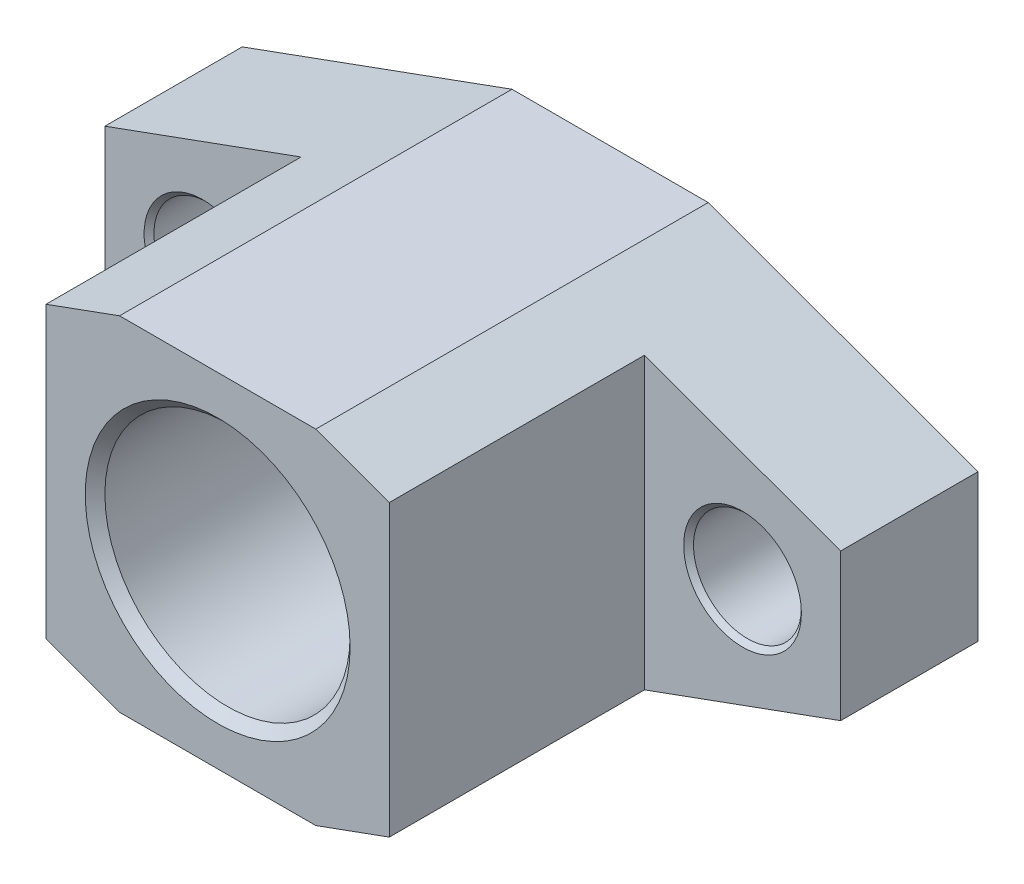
ISO-10303-21;
HEADER;
FILE_DESCRIPTION(('STEP AP214'),'2;1');
FILE_NAME('part.step','',(''),(''),'','','');
FILE_SCHEMA(('AUTOMOTIVE_DESIGN { 1 0 10303 214 1 1 1 1 }'));
ENDSEC;
DATA;
#1=APPLICATION_CONTEXT('core data for automotive mechanical design processes');
#2=APPLICATION_PROTOCOL_DEFINITION('international standard','automotive_design',2000,#1);
#3=PRODUCT_CONTEXT('',#1,'mechanical');
#4=PRODUCT('Part','Part','',(#3));
#5=PRODUCT_RELATED_PRODUCT_CATEGORY('part','',(#4));
#6=PRODUCT_DEFINITION_FORMATION('','',#4);
#7=PRODUCT_DEFINITION_CONTEXT('part definition',#1,'design');
#8=PRODUCT_DEFINITION('design','',#6,#7);
#9=PRODUCT_DEFINITION_SHAPE('','',#8);
#10=(LENGTH_UNIT() NAMED_UNIT(*) SI_UNIT(.MILLI.,.METRE.));
#11=(NAMED_UNIT(*) PLANE_ANGLE_UNIT() SI_UNIT($,.RADIAN.));
#12=(NAMED_UNIT(*) SI_UNIT($,.STERADIAN.) SOLID_ANGLE_UNIT());
#13=UNCERTAINTY_MEASURE_WITH_UNIT(LENGTH_MEASURE(1.E-05),#10,'distance_accuracy_value','');
#14=(GEOMETRIC_REPRESENTATION_CONTEXT(3) GLOBAL_UNCERTAINTY_ASSIGNED_CONTEXT((#13)) GLOBAL_UNIT_ASSIGNED_CONTEXT((#10,
#11,#12)) REPRESENTATION_CONTEXT('',''));
#15=CARTESIAN_POINT('',(0.,0.,0.));
#16=DIRECTION('',(0.,0.,1.));
#17=DIRECTION('',(1.,0.,0.));
#18=AXIS2_PLACEMENT_3D('',#15,#16,#17);
#19=CARTESIAN_POINT('',(-37.5,7.49081855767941,14.));
#20=DIRECTION('',(0.,0.,1.));
#21=DIRECTION('',(1.,0.,0.));
#22=AXIS2_PLACEMENT_3D('',#19,#20,#21);
#23=PLANE('',#22);
#24=CARTESIAN_POINT('',(27.5,0.,14.));
#25=DIRECTION('',(0.,0.,1.));
#26=DIRECTION('',(1.,0.,0.));
#27=AXIS2_PLACEMENT_3D('',#24,#25,#26);
#28=CIRCLE('',#27,6.);
#29=CARTESIAN_POINT('',(33.5,0.,14.));
#30=VERTEX_POINT('',#29);
#31=EDGE_CURVE('E486',#30,#30,#28,.T.);
#32=ORIENTED_EDGE('',*,*,#31,.F.);
#33=EDGE_LOOP('',(#32));
#34=FACE_BOUND('',#33,.T.);
#35=DIRECTION('',(0.,1.,0.));
#36=VECTOR('',#35,1.);
#37=CARTESIAN_POINT('',(17.5,14.7702232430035,14.));
#38=LINE('',#37,#36);
#39=CARTESIAN_POINT('',(17.5,-14.7702232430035,14.));
#40=VERTEX_POINT('',#39);
#41=CARTESIAN_POINT('',(17.5,14.7702232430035,14.));
#42=VERTEX_POINT('',#41);
#43=EDGE_CURVE('E35',#40,#42,#38,.T.);
#44=ORIENTED_EDGE('',*,*,#43,.F.);
#45=DIRECTION('',(0.939692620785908,0.342020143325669,0.));
#46=VECTOR('',#45,1.);
#47=CARTESIAN_POINT('',(10.,-17.5,14.));
#48=LINE('',#47,#46);
#49=CARTESIAN_POINT('',(37.5,-7.49081855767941,14.));
#50=VERTEX_POINT('',#49);
#51=EDGE_CURVE('E161',#40,#50,#48,.T.);
#52=ORIENTED_EDGE('',*,*,#51,.T.);
#53=DIRECTION('',(0.,1.,0.));
#54=VECTOR('',#53,1.);
#55=CARTESIAN_POINT('',(37.5,7.49081855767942,14.));
#56=LINE('',#55,#54);
#57=CARTESIAN_POINT('',(37.5,7.49081855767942,14.));
#58=VERTEX_POINT('',#57);
#59=EDGE_CURVE('E167',#50,#58,#56,.T.);
#60=ORIENTED_EDGE('',*,*,#59,.T.);
#61=DIRECTION('',(-0.939692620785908,0.342020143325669,0.));
#62=VECTOR('',#61,1.);
#63=CARTESIAN_POINT('',(10.,17.5,14.));
#64=LINE('',#63,#62);
#65=EDGE_CURVE('E31',#58,#42,#64,.T.);
#66=ORIENTED_EDGE('',*,*,#65,.T.);
#67=EDGE_LOOP('',(#44,#52,#60,#66));
#68=FACE_BOUND('',#67,.T.);
#69=ADVANCED_FACE('F14',(#34,#68),#23,.T.);
#70=CARTESIAN_POINT('',(-10.,17.5,14.));
#71=DIRECTION('',(0.342020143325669,-0.939692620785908,0.));
#72=DIRECTION('',(0.939692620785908,0.342020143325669,0.));
#73=AXIS2_PLACEMENT_3D('',#70,#71,#72);
#74=PLANE('',#73);
#75=DIRECTION('',(-0.939692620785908,-0.342020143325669,0.));
#76=VECTOR('',#75,1.);
#77=CARTESIAN_POINT('',(-10.,17.5,0.));
#78=LINE('',#77,#76);
#79=CARTESIAN_POINT('',(-10.,17.5,0.));
#80=VERTEX_POINT('',#79);
#81=CARTESIAN_POINT('',(-37.5,7.49081855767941,0.));
#82=VERTEX_POINT('',#81);
#83=EDGE_CURVE('E130',#80,#82,#78,.T.);
#84=ORIENTED_EDGE('',*,*,#83,.T.);
#85=DIRECTION('',(0.,0.,-1.));
#86=VECTOR('',#85,1.);
#87=CARTESIAN_POINT('',(-37.5,7.49081855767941,14.));
#88=LINE('',#87,#86);
#89=CARTESIAN_POINT('',(-37.5,7.49081855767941,14.));
#90=VERTEX_POINT('',#89);
#91=EDGE_CURVE('E9',#90,#82,#88,.T.);
#92=ORIENTED_EDGE('',*,*,#91,.F.);
#93=DIRECTION('',(-0.939692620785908,-0.342020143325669,0.));
#94=VECTOR('',#93,1.);
#95=CARTESIAN_POINT('',(-10.,17.5,14.));
#96=LINE('',#95,#94);
#97=CARTESIAN_POINT('',(-17.5,14.7702232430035,14.));
#98=VERTEX_POINT('',#97);
#99=EDGE_CURVE('E129',#98,#90,#96,.T.);
#100=ORIENTED_EDGE('',*,*,#99,.F.);
#101=DIRECTION('',(0.,0.,-1.));
#102=VECTOR('',#101,1.);
#103=CARTESIAN_POINT('',(-17.5,14.7702232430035,40.));
#104=LINE('',#103,#102);
#105=CARTESIAN_POINT('',(-17.5,14.7702232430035,40.));
#106=VERTEX_POINT('',#105);
#107=EDGE_CURVE('E108',#106,#98,#104,.T.);
#108=ORIENTED_EDGE('',*,*,#107,.F.);
#109=DIRECTION('',(-0.939692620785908,-0.342020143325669,0.));
#110=VECTOR('',#109,1.);
#111=CARTESIAN_POINT('',(-10.,17.5,40.));
#112=LINE('',#111,#110);
#113=CARTESIAN_POINT('',(-10.,17.5,40.));
#114=VERTEX_POINT('',#113);
#115=EDGE_CURVE('E115',#114,#106,#112,.T.);
#116=ORIENTED_EDGE('',*,*,#115,.F.);
#117=DIRECTION('',(0.,0.,-1.));
#118=VECTOR('',#117,1.);
#119=CARTESIAN_POINT('',(-10.,17.5,14.));
#120=LINE('',#119,#118);
#121=EDGE_CURVE('E172',#114,#80,#120,.T.);
#122=ORIENTED_EDGE('',*,*,#121,.T.);
#123=EDGE_LOOP('',(#84,#92,#100,#108,#116,#122));
#124=FACE_BOUND('',#123,.T.);
#125=ADVANCED_FACE('F16',(#124),#74,.F.);
#126=CARTESIAN_POINT('',(-37.5,7.49081855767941,14.));
#127=DIRECTION('',(1.,0.,0.));
#128=DIRECTION('',(0.,0.,-1.));
#129=AXIS2_PLACEMENT_3D('',#126,#127,#128);
#130=PLANE('',#129);
#131=DIRECTION('',(0.,-1.,0.));
#132=VECTOR('',#131,1.);
#133=CARTESIAN_POINT('',(-37.5,7.49081855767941,0.));
#134=LINE('',#133,#132);
#135=CARTESIAN_POINT('',(-37.5,-7.49081855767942,0.));
#136=VERTEX_POINT('',#135);
#137=EDGE_CURVE('E132',#82,#136,#134,.T.);
#138=ORIENTED_EDGE('',*,*,#137,.T.);
#139=DIRECTION('',(0.,0.,-1.));
#140=VECTOR('',#139,1.);
#141=CARTESIAN_POINT('',(-37.5,-7.49081855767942,14.));
#142=LINE('',#141,#140);
#143=CARTESIAN_POINT('',(-37.5,-7.49081855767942,14.));
#144=VERTEX_POINT('',#143);
#145=EDGE_CURVE('E23',#144,#136,#142,.T.);
#146=ORIENTED_EDGE('',*,*,#145,.F.);
#147=DIRECTION('',(0.,-1.,0.));
#148=VECTOR('',#147,1.);
#149=CARTESIAN_POINT('',(-37.5,7.49081855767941,14.));
#150=LINE('',#149,#148);
#151=EDGE_CURVE('E153',#90,#144,#150,.T.);
#152=ORIENTED_EDGE('',*,*,#151,.F.);
#153=ORIENTED_EDGE('',*,*,#91,.T.);
#154=EDGE_LOOP('',(#138,#146,#152,#153));
#155=FACE_BOUND('',#154,.T.);
#156=ADVANCED_FACE('F244',(#155),#130,.F.);
#157=CARTESIAN_POINT('',(-10.,-17.5,14.));
#158=DIRECTION('',(0.342020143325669,0.939692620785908,0.));
#159=DIRECTION('',(-0.939692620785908,0.342020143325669,0.));
#160=AXIS2_PLACEMENT_3D('',#157,#158,#159);
#161=PLANE('',#160);
#162=DIRECTION('',(0.939692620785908,-0.342020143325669,0.));
#163=VECTOR('',#162,1.);
#164=CARTESIAN_POINT('',(-10.,-17.5,0.));
#165=LINE('',#164,#163);
#166=CARTESIAN_POINT('',(-10.,-17.5,0.));
#167=VERTEX_POINT('',#166);
#168=EDGE_CURVE('E288',#136,#167,#165,.T.);
#169=ORIENTED_EDGE('',*,*,#168,.T.);
#170=DIRECTION('',(0.,0.,-1.));
#171=VECTOR('',#170,1.);
#172=CARTESIAN_POINT('',(-10.,-17.5,14.));
#173=LINE('',#172,#171);
#174=CARTESIAN_POINT('',(-10.,-17.5,40.));
#175=VERTEX_POINT('',#174);
#176=EDGE_CURVE('E268',#175,#167,#173,.T.);
#177=ORIENTED_EDGE('',*,*,#176,.F.);
#178=DIRECTION('',(0.939692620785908,-0.342020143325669,0.));
#179=VECTOR('',#178,1.);
#180=CARTESIAN_POINT('',(-17.5,-14.7702232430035,40.));
#181=LINE('',#180,#179);
#182=CARTESIAN_POINT('',(-17.5,-14.7702232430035,40.));
#183=VERTEX_POINT('',#182);
#184=EDGE_CURVE('E114',#183,#175,#181,.T.);
#185=ORIENTED_EDGE('',*,*,#184,.F.);
#186=DIRECTION('',(0.,0.,-1.));
#187=VECTOR('',#186,1.);
#188=CARTESIAN_POINT('',(-17.5,-14.7702232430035,40.));
#189=LINE('',#188,#187);
#190=CARTESIAN_POINT('',(-17.5,-14.7702232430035,14.));
#191=VERTEX_POINT('',#190);
#192=EDGE_CURVE('E110',#183,#191,#189,.T.);
#193=ORIENTED_EDGE('',*,*,#192,.T.);
#194=DIRECTION('',(0.939692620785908,-0.342020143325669,0.));
#195=VECTOR('',#194,1.);
#196=CARTESIAN_POINT('',(-10.,-17.5,14.));
#197=LINE('',#196,#195);
#198=EDGE_CURVE('E159',#144,#191,#197,.T.);
#199=ORIENTED_EDGE('',*,*,#198,.F.);
#200=ORIENTED_EDGE('',*,*,#145,.T.);
#201=EDGE_LOOP('',(#169,#177,#185,#193,#199,#200));
#202=FACE_BOUND('',#201,.T.);
#203=ADVANCED_FACE('F265',(#202),#161,.F.);
#204=CARTESIAN_POINT('',(10.,-17.5,14.));
#205=DIRECTION('',(0.,1.,0.));
#206=DIRECTION('',(-1.,0.,0.));
#207=AXIS2_PLACEMENT_3D('',#204,#205,#206);
#208=PLANE('',#207);
#209=DIRECTION('',(1.,0.,0.));
#210=VECTOR('',#209,1.);
#211=CARTESIAN_POINT('',(10.,-17.5,0.));
#212=LINE('',#211,#210);
#213=CARTESIAN_POINT('',(10.,-17.5,0.));
#214=VERTEX_POINT('',#213);
#215=EDGE_CURVE('E274',#167,#214,#212,.T.);
#216=ORIENTED_EDGE('',*,*,#215,.T.);
#217=DIRECTION('',(0.,0.,-1.));
#218=VECTOR('',#217,1.);
#219=CARTESIAN_POINT('',(10.,-17.5,14.));
#220=LINE('',#219,#218);
#221=CARTESIAN_POINT('',(10.,-17.5,40.));
#222=VERTEX_POINT('',#221);
#223=EDGE_CURVE('E273',#222,#214,#220,.T.);
#224=ORIENTED_EDGE('',*,*,#223,.F.);
#225=DIRECTION('',(1.,0.,0.));
#226=VECTOR('',#225,1.);
#227=CARTESIAN_POINT('',(-10.,-17.5,40.));
#228=LINE('',#227,#226);
#229=EDGE_CURVE('E185',#175,#222,#228,.T.);
#230=ORIENTED_EDGE('',*,*,#229,.F.);
#231=ORIENTED_EDGE('',*,*,#176,.T.);
#232=EDGE_LOOP('',(#216,#224,#230,#231));
#233=FACE_BOUND('',#232,.T.);
#234=ADVANCED_FACE('F271',(#233),#208,.F.);
#235=CARTESIAN_POINT('',(10.,-17.5,14.));
#236=DIRECTION('',(-0.342020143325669,0.939692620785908,0.));
#237=DIRECTION('',(-0.939692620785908,-0.342020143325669,0.));
#238=AXIS2_PLACEMENT_3D('',#235,#236,#237);
#239=PLANE('',#238);
#240=DIRECTION('',(0.939692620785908,0.342020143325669,0.));
#241=VECTOR('',#240,1.);
#242=CARTESIAN_POINT('',(10.,-17.5,0.));
#243=LINE('',#242,#241);
#244=CARTESIAN_POINT('',(37.5,-7.49081855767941,0.));
#245=VERTEX_POINT('',#244);
#246=EDGE_CURVE('E285',#214,#245,#243,.T.);
#247=ORIENTED_EDGE('',*,*,#246,.T.);
#248=DIRECTION('',(0.,0.,-1.));
#249=VECTOR('',#248,1.);
#250=CARTESIAN_POINT('',(37.5,-7.49081855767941,14.));
#251=LINE('',#250,#249);
#252=EDGE_CURVE('E209',#50,#245,#251,.T.);
#253=ORIENTED_EDGE('',*,*,#252,.F.);
#254=ORIENTED_EDGE('',*,*,#51,.F.);
#255=DIRECTION('',(0.,0.,-1.));
#256=VECTOR('',#255,1.);
#257=CARTESIAN_POINT('',(17.5,-14.7702232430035,40.));
#258=LINE('',#257,#256);
#259=CARTESIAN_POINT('',(17.5,-14.7702232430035,40.));
#260=VERTEX_POINT('',#259);
#261=EDGE_CURVE('E134',#260,#40,#258,.T.);
#262=ORIENTED_EDGE('',*,*,#261,.F.);
#263=DIRECTION('',(0.939692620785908,0.34202014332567,0.));
#264=VECTOR('',#263,1.);
#265=CARTESIAN_POINT('',(10.,-17.5,40.));
#266=LINE('',#265,#264);
#267=EDGE_CURVE('E188',#222,#260,#266,.T.);
#268=ORIENTED_EDGE('',*,*,#267,.F.);
#269=ORIENTED_EDGE('',*,*,#223,.T.);
#270=EDGE_LOOP('',(#247,#253,#254,#262,#268,#269));
#271=FACE_BOUND('',#270,.T.);
#272=ADVANCED_FACE('F205',(#271),#239,.F.);
#273=CARTESIAN_POINT('',(37.5,7.49081855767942,14.));
#274=DIRECTION('',(-1.,0.,0.));
#275=DIRECTION('',(0.,0.,1.));
#276=AXIS2_PLACEMENT_3D('',#273,#274,#275);
#277=PLANE('',#276);
#278=DIRECTION('',(0.,1.,0.));
#279=VECTOR('',#278,1.);
#280=CARTESIAN_POINT('',(37.5,7.49081855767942,0.));
#281=LINE('',#280,#279);
#282=CARTESIAN_POINT('',(37.5,7.49081855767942,0.));
#283=VERTEX_POINT('',#282);
#284=EDGE_CURVE('E217',#245,#283,#281,.T.);
#285=ORIENTED_EDGE('',*,*,#284,.T.);
#286=DIRECTION('',(0.,0.,-1.));
#287=VECTOR('',#286,1.);
#288=CARTESIAN_POINT('',(37.5,7.49081855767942,14.));
#289=LINE('',#288,#287);
#290=EDGE_CURVE('E214',#58,#283,#289,.T.);
#291=ORIENTED_EDGE('',*,*,#290,.F.);
#292=ORIENTED_EDGE('',*,*,#59,.F.);
#293=ORIENTED_EDGE('',*,*,#252,.T.);
#294=EDGE_LOOP('',(#285,#291,#292,#293));
#295=FACE_BOUND('',#294,.T.);
#296=ADVANCED_FACE('F215',(#295),#277,.F.);
#297=CARTESIAN_POINT('',(10.,17.5,14.));
#298=DIRECTION('',(-0.342020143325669,-0.939692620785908,0.));
#299=DIRECTION('',(0.939692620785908,-0.342020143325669,0.));
#300=AXIS2_PLACEMENT_3D('',#297,#298,#299);
#301=PLANE('',#300);
#302=DIRECTION('',(-0.939692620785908,0.342020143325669,0.));
#303=VECTOR('',#302,1.);
#304=CARTESIAN_POINT('',(10.,17.5,0.));
#305=LINE('',#304,#303);
#306=CARTESIAN_POINT('',(10.,17.5,0.));
#307=VERTEX_POINT('',#306);
#308=EDGE_CURVE('E222',#283,#307,#305,.T.);
#309=ORIENTED_EDGE('',*,*,#308,.T.);
#310=DIRECTION('',(0.,0.,-1.));
#311=VECTOR('',#310,1.);
#312=CARTESIAN_POINT('',(10.,17.5,14.));
#313=LINE('',#312,#311);
#314=CARTESIAN_POINT('',(10.,17.5,40.));
#315=VERTEX_POINT('',#314);
#316=EDGE_CURVE('E219',#315,#307,#313,.T.);
#317=ORIENTED_EDGE('',*,*,#316,.F.);
#318=DIRECTION('',(-0.939692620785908,0.34202014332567,0.));
#319=VECTOR('',#318,1.);
#320=CARTESIAN_POINT('',(17.5,14.7702232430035,40.));
#321=LINE('',#320,#319);
#322=CARTESIAN_POINT('',(17.5,14.7702232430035,40.));
#323=VERTEX_POINT('',#322);
#324=EDGE_CURVE('E192',#323,#315,#321,.T.);
#325=ORIENTED_EDGE('',*,*,#324,.F.);
#326=DIRECTION('',(0.,0.,-1.));
#327=VECTOR('',#326,1.);
#328=CARTESIAN_POINT('',(17.5,14.7702232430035,40.));
#329=LINE('',#328,#327);
#330=EDGE_CURVE('E144',#323,#42,#329,.T.);
#331=ORIENTED_EDGE('',*,*,#330,.T.);
#332=ORIENTED_EDGE('',*,*,#65,.F.);
#333=ORIENTED_EDGE('',*,*,#290,.T.);
#334=EDGE_LOOP('',(#309,#317,#325,#331,#332,#333));
#335=FACE_BOUND('',#334,.T.);
#336=ADVANCED_FACE('F221',(#335),#301,.F.);
#337=CARTESIAN_POINT('',(10.,17.5,14.));
#338=DIRECTION('',(0.,-1.,0.));
#339=DIRECTION('',(1.,0.,0.));
#340=AXIS2_PLACEMENT_3D('',#337,#338,#339);
#341=PLANE('',#340);
#342=DIRECTION('',(-1.,0.,0.));
#343=VECTOR('',#342,1.);
#344=CARTESIAN_POINT('',(10.,17.5,0.));
#345=LINE('',#344,#343);
#346=EDGE_CURVE('E157',#307,#80,#345,.T.);
#347=ORIENTED_EDGE('',*,*,#346,.T.);
#348=ORIENTED_EDGE('',*,*,#121,.F.);
#349=DIRECTION('',(-1.,0.,0.));
#350=VECTOR('',#349,1.);
#351=CARTESIAN_POINT('',(10.,17.5,40.));
#352=LINE('',#351,#350);
#353=EDGE_CURVE('E122',#315,#114,#352,.T.);
#354=ORIENTED_EDGE('',*,*,#353,.F.);
#355=ORIENTED_EDGE('',*,*,#316,.T.);
#356=EDGE_LOOP('',(#347,#348,#354,#355));
#357=FACE_BOUND('',#356,.T.);
#358=ADVANCED_FACE('F225',(#357),#341,.F.);
#359=CARTESIAN_POINT('',(-27.5,0.,14.));
#360=DIRECTION('',(0.,0.,1.));
#361=DIRECTION('',(1.,0.,0.));
#362=AXIS2_PLACEMENT_3D('',#359,#360,#361);
#363=CIRCLE('',#362,6.);
#364=CARTESIAN_POINT('',(-21.5,0.,14.));
#365=VERTEX_POINT('',#364);
#366=EDGE_CURVE('E259',#365,#365,#363,.T.);
#367=ORIENTED_EDGE('',*,*,#366,.F.);
#368=EDGE_LOOP('',(#367));
#369=FACE_BOUND('',#368,.T.);
#370=DIRECTION('',(0.,-1.,0.));
#371=VECTOR('',#370,1.);
#372=CARTESIAN_POINT('',(-17.5,14.7702232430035,14.));
#373=LINE('',#372,#371);
#374=EDGE_CURVE('E143',#98,#191,#373,.T.);
#375=ORIENTED_EDGE('',*,*,#374,.F.);
#376=ORIENTED_EDGE('',*,*,#99,.T.);
#377=ORIENTED_EDGE('',*,*,#151,.T.);
#378=ORIENTED_EDGE('',*,*,#198,.T.);
#379=EDGE_LOOP('',(#375,#376,#377,#378));
#380=FACE_BOUND('',#379,.T.);
#381=ADVANCED_FACE('F233',(#369,#380),#23,.T.);
#382=CARTESIAN_POINT('',(-37.5,7.49081855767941,0.));
#383=DIRECTION('',(0.,0.,1.));
#384=DIRECTION('',(1.,0.,0.));
#385=AXIS2_PLACEMENT_3D('',#382,#383,#384);
#386=PLANE('',#385);
#387=CARTESIAN_POINT('',(-27.5,0.,0.));
#388=DIRECTION('',(0.,0.,1.));
#389=DIRECTION('',(1.,0.,0.));
#390=AXIS2_PLACEMENT_3D('',#387,#388,#389);
#391=CIRCLE('',#390,6.);
#392=CARTESIAN_POINT('',(-21.5,0.,0.));
#393=VERTEX_POINT('',#392);
#394=EDGE_CURVE('E483',#393,#393,#391,.T.);
#395=ORIENTED_EDGE('',*,*,#394,.T.);
#396=EDGE_LOOP('',(#395));
#397=FACE_BOUND('',#396,.T.);
#398=CARTESIAN_POINT('',(27.5,0.,0.));
#399=DIRECTION('',(0.,0.,1.));
#400=DIRECTION('',(1.,0.,0.));
#401=AXIS2_PLACEMENT_3D('',#398,#399,#400);
#402=CIRCLE('',#401,6.);
#403=CARTESIAN_POINT('',(33.5,0.,0.));
#404=VERTEX_POINT('',#403);
#405=EDGE_CURVE('E495',#404,#404,#402,.T.);
#406=ORIENTED_EDGE('',*,*,#405,.T.);
#407=EDGE_LOOP('',(#406));
#408=FACE_BOUND('',#407,.T.);
#409=CARTESIAN_POINT('',(0.,0.,0.));
#410=DIRECTION('',(0.,0.,1.));
#411=DIRECTION('',(1.,0.,0.));
#412=AXIS2_PLACEMENT_3D('',#409,#410,#411);
#413=CIRCLE('',#412,13.5);
#414=CARTESIAN_POINT('',(13.5,0.,0.));
#415=VERTEX_POINT('',#414);
#416=EDGE_CURVE('E173',#415,#415,#413,.T.);
#417=ORIENTED_EDGE('',*,*,#416,.T.);
#418=EDGE_LOOP('',(#417));
#419=FACE_BOUND('',#418,.T.);
#420=ORIENTED_EDGE('',*,*,#83,.F.);
#421=ORIENTED_EDGE('',*,*,#346,.F.);
#422=ORIENTED_EDGE('',*,*,#308,.F.);
#423=ORIENTED_EDGE('',*,*,#284,.F.);
#424=ORIENTED_EDGE('',*,*,#246,.F.);
#425=ORIENTED_EDGE('',*,*,#215,.F.);
#426=ORIENTED_EDGE('',*,*,#168,.F.);
#427=ORIENTED_EDGE('',*,*,#137,.F.);
#428=EDGE_LOOP('',(#420,#421,#422,#423,#424,#425,#426,#427));
#429=FACE_BOUND('',#428,.T.);
#430=ADVANCED_FACE('F249',(#397,#408,#419,#429),#386,.F.);
#431=CARTESIAN_POINT('',(-17.5,14.7702232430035,40.));
#432=DIRECTION('',(1.,0.,0.));
#433=DIRECTION('',(0.,1.,0.));
#434=AXIS2_PLACEMENT_3D('',#431,#432,#433);
#435=PLANE('',#434);
#436=ORIENTED_EDGE('',*,*,#374,.T.);
#437=ORIENTED_EDGE('',*,*,#192,.F.);
#438=DIRECTION('',(0.,-1.,0.));
#439=VECTOR('',#438,1.);
#440=CARTESIAN_POINT('',(-17.5,14.7702232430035,40.));
#441=LINE('',#440,#439);
#442=EDGE_CURVE('E103',#106,#183,#441,.T.);
#443=ORIENTED_EDGE('',*,*,#442,.F.);
#444=ORIENTED_EDGE('',*,*,#107,.T.);
#445=EDGE_LOOP('',(#436,#437,#443,#444));
#446=FACE_BOUND('',#445,.T.);
#447=ADVANCED_FACE('F106',(#446),#435,.F.);
#448=CARTESIAN_POINT('',(17.5,14.7702232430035,40.));
#449=DIRECTION('',(-1.,0.,0.));
#450=DIRECTION('',(0.,-1.,0.));
#451=AXIS2_PLACEMENT_3D('',#448,#449,#450);
#452=PLANE('',#451);
#453=ORIENTED_EDGE('',*,*,#43,.T.);
#454=ORIENTED_EDGE('',*,*,#330,.F.);
#455=DIRECTION('',(0.,1.,0.));
#456=VECTOR('',#455,1.);
#457=CARTESIAN_POINT('',(17.5,14.7702232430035,40.));
#458=LINE('',#457,#456);
#459=EDGE_CURVE('E190',#260,#323,#458,.T.);
#460=ORIENTED_EDGE('',*,*,#459,.F.);
#461=ORIENTED_EDGE('',*,*,#261,.T.);
#462=EDGE_LOOP('',(#453,#454,#460,#461));
#463=FACE_BOUND('',#462,.T.);
#464=ADVANCED_FACE('F202',(#463),#452,.F.);
#465=CARTESIAN_POINT('',(-17.5,14.7702232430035,40.));
#466=DIRECTION('',(0.,0.,1.));
#467=DIRECTION('',(1.,0.,0.));
#468=AXIS2_PLACEMENT_3D('',#465,#466,#467);
#469=PLANE('',#468);
#470=CARTESIAN_POINT('',(0.,0.,40.));
#471=DIRECTION('',(0.,0.,1.));
#472=DIRECTION('',(1.,0.,0.));
#473=AXIS2_PLACEMENT_3D('',#470,#471,#472);
#474=CIRCLE('',#473,13.5);
#475=CARTESIAN_POINT('',(13.5,0.,40.));
#476=VERTEX_POINT('',#475);
#477=EDGE_CURVE('E498',#476,#476,#474,.T.);
#478=ORIENTED_EDGE('',*,*,#477,.F.);
#479=EDGE_LOOP('',(#478));
#480=FACE_BOUND('',#479,.T.);
#481=ORIENTED_EDGE('',*,*,#115,.T.);
#482=ORIENTED_EDGE('',*,*,#442,.T.);
#483=ORIENTED_EDGE('',*,*,#184,.T.);
#484=ORIENTED_EDGE('',*,*,#229,.T.);
#485=ORIENTED_EDGE('',*,*,#267,.T.);
#486=ORIENTED_EDGE('',*,*,#459,.T.);
#487=ORIENTED_EDGE('',*,*,#324,.T.);
#488=ORIENTED_EDGE('',*,*,#353,.T.);
#489=EDGE_LOOP('',(#481,#482,#483,#484,#485,#486,#487,#488));
#490=FACE_BOUND('',#489,.T.);
#491=ADVANCED_FACE('F119',(#480,#490),#469,.T.);
#492=CARTESIAN_POINT('',(0.,0.,1.));
#493=DIRECTION('',(0.,0.,-1.));
#494=DIRECTION('',(-1.,0.,0.));
#495=AXIS2_PLACEMENT_3D('',#492,#493,#494);
#496=CONICAL_SURFACE('',#495,12.5,0.785398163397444);
#497=ORIENTED_EDGE('',*,*,#416,.F.);
#498=EDGE_LOOP('',(#497));
#499=FACE_BOUND('',#498,.T.);
#500=CARTESIAN_POINT('',(0.,0.,1.));
#501=DIRECTION('',(0.,0.,1.));
#502=DIRECTION('',(1.,0.,0.));
#503=AXIS2_PLACEMENT_3D('',#500,#501,#502);
#504=CIRCLE('',#503,12.5);
#505=CARTESIAN_POINT('',(12.5,0.,1.));
#506=VERTEX_POINT('',#505);
#507=EDGE_CURVE('E175',#506,#506,#504,.T.);
#508=ORIENTED_EDGE('',*,*,#507,.T.);
#509=EDGE_LOOP('',(#508));
#510=FACE_BOUND('',#509,.T.);
#511=ADVANCED_FACE('F377',(#499,#510),#496,.F.);
#512=CARTESIAN_POINT('',(0.,0.,40.));
#513=DIRECTION('',(0.,0.,1.));
#514=DIRECTION('',(1.,0.,0.));
#515=AXIS2_PLACEMENT_3D('',#512,#513,#514);
#516=CYLINDRICAL_SURFACE('',#515,12.5);
#517=ORIENTED_EDGE('',*,*,#507,.F.);
#518=EDGE_LOOP('',(#517));
#519=FACE_BOUND('',#518,.T.);
#520=CARTESIAN_POINT('',(0.,0.,39.));
#521=DIRECTION('',(0.,0.,1.));
#522=DIRECTION('',(1.,0.,0.));
#523=AXIS2_PLACEMENT_3D('',#520,#521,#522);
#524=CIRCLE('',#523,12.5);
#525=CARTESIAN_POINT('',(12.5,0.,39.));
#526=VERTEX_POINT('',#525);
#527=EDGE_CURVE('E180',#526,#526,#524,.T.);
#528=ORIENTED_EDGE('',*,*,#527,.T.);
#529=EDGE_LOOP('',(#528));
#530=FACE_BOUND('',#529,.T.);
#531=ADVANCED_FACE('F386',(#519,#530),#516,.F.);
#532=CARTESIAN_POINT('',(0.,0.,40.));
#533=DIRECTION('',(0.,0.,1.));
#534=DIRECTION('',(1.,0.,0.));
#535=AXIS2_PLACEMENT_3D('',#532,#533,#534);
#536=CONICAL_SURFACE('',#535,13.5,0.785398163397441);
#537=ORIENTED_EDGE('',*,*,#527,.F.);
#538=EDGE_LOOP('',(#537));
#539=FACE_BOUND('',#538,.T.);
#540=ORIENTED_EDGE('',*,*,#477,.T.);
#541=EDGE_LOOP('',(#540));
#542=FACE_BOUND('',#541,.T.);
#543=ADVANCED_FACE('F395',(#539,#542),#536,.F.);
#544=CARTESIAN_POINT('',(27.5,0.,0.5));
#545=DIRECTION('',(0.,0.,-1.));
#546=DIRECTION('',(-1.,0.,0.));
#547=AXIS2_PLACEMENT_3D('',#544,#545,#546);
#548=CONICAL_SURFACE('',#547,5.5,0.785398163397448);
#549=ORIENTED_EDGE('',*,*,#405,.F.);
#550=EDGE_LOOP('',(#549));
#551=FACE_BOUND('',#550,.T.);
#552=CARTESIAN_POINT('',(27.5,0.,0.5));
#553=DIRECTION('',(0.,0.,1.));
#554=DIRECTION('',(1.,0.,0.));
#555=AXIS2_PLACEMENT_3D('',#552,#553,#554);
#556=CIRCLE('',#555,5.5);
#557=CARTESIAN_POINT('',(33.,0.,0.5));
#558=VERTEX_POINT('',#557);
#559=EDGE_CURVE('E492',#558,#558,#556,.T.);
#560=ORIENTED_EDGE('',*,*,#559,.T.);
#561=EDGE_LOOP('',(#560));
#562=FACE_BOUND('',#561,.T.);
#563=ADVANCED_FACE('F404',(#551,#562),#548,.F.);
#564=CARTESIAN_POINT('',(27.5,0.,14.));
#565=DIRECTION('',(0.,0.,1.));
#566=DIRECTION('',(1.,0.,0.));
#567=AXIS2_PLACEMENT_3D('',#564,#565,#566);
#568=CYLINDRICAL_SURFACE('',#567,5.5);
#569=ORIENTED_EDGE('',*,*,#559,.F.);
#570=EDGE_LOOP('',(#569));
#571=FACE_BOUND('',#570,.T.);
#572=CARTESIAN_POINT('',(27.5,0.,13.5));
#573=DIRECTION('',(0.,0.,1.));
#574=DIRECTION('',(1.,0.,0.));
#575=AXIS2_PLACEMENT_3D('',#572,#573,#574);
#576=CIRCLE('',#575,5.5);
#577=CARTESIAN_POINT('',(33.,0.,13.5));
#578=VERTEX_POINT('',#577);
#579=EDGE_CURVE('E489',#578,#578,#576,.T.);
#580=ORIENTED_EDGE('',*,*,#579,.T.);
#581=EDGE_LOOP('',(#580));
#582=FACE_BOUND('',#581,.T.);
#583=ADVANCED_FACE('F413',(#571,#582),#568,.F.);
#584=CARTESIAN_POINT('',(27.5,0.,14.));
#585=DIRECTION('',(0.,0.,1.));
#586=DIRECTION('',(1.,0.,0.));
#587=AXIS2_PLACEMENT_3D('',#584,#585,#586);
#588=CONICAL_SURFACE('',#587,6.,0.78539816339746);
#589=ORIENTED_EDGE('',*,*,#579,.F.);
#590=EDGE_LOOP('',(#589));
#591=FACE_BOUND('',#590,.T.);
#592=ORIENTED_EDGE('',*,*,#31,.T.);
#593=EDGE_LOOP('',(#592));
#594=FACE_BOUND('',#593,.T.);
#595=ADVANCED_FACE('F422',(#591,#594),#588,.F.);
#596=CARTESIAN_POINT('',(-27.5,0.,0.5));
#597=DIRECTION('',(0.,0.,-1.));
#598=DIRECTION('',(-1.,0.,0.));
#599=AXIS2_PLACEMENT_3D('',#596,#597,#598);
#600=CONICAL_SURFACE('',#599,5.5,0.785398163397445);
#601=ORIENTED_EDGE('',*,*,#394,.F.);
#602=EDGE_LOOP('',(#601));
#603=FACE_BOUND('',#602,.T.);
#604=CARTESIAN_POINT('',(-27.5,0.,0.5));
#605=DIRECTION('',(0.,0.,1.));
#606=DIRECTION('',(1.,0.,0.));
#607=AXIS2_PLACEMENT_3D('',#604,#605,#606);
#608=CIRCLE('',#607,5.5);
#609=CARTESIAN_POINT('',(-22.,0.,0.5));
#610=VERTEX_POINT('',#609);
#611=EDGE_CURVE('E478',#610,#610,#608,.T.);
#612=ORIENTED_EDGE('',*,*,#611,.T.);
#613=EDGE_LOOP('',(#612));
#614=FACE_BOUND('',#613,.T.);
#615=ADVANCED_FACE('F431',(#603,#614),#600,.F.);
#616=CARTESIAN_POINT('',(-27.5,0.,14.));
#617=DIRECTION('',(0.,0.,1.));
#618=DIRECTION('',(1.,0.,0.));
#619=AXIS2_PLACEMENT_3D('',#616,#617,#618);
#620=CYLINDRICAL_SURFACE('',#619,5.5);
#621=ORIENTED_EDGE('',*,*,#611,.F.);
#622=EDGE_LOOP('',(#621));
#623=FACE_BOUND('',#622,.T.);
#624=CARTESIAN_POINT('',(-27.5,0.,13.5));
#625=DIRECTION('',(0.,0.,1.));
#626=DIRECTION('',(1.,0.,0.));
#627=AXIS2_PLACEMENT_3D('',#624,#625,#626);
#628=CIRCLE('',#627,5.5);
#629=CARTESIAN_POINT('',(-22.,0.,13.5));
#630=VERTEX_POINT('',#629);
#631=EDGE_CURVE('E476',#630,#630,#628,.T.);
#632=ORIENTED_EDGE('',*,*,#631,.T.);
#633=EDGE_LOOP('',(#632));
#634=FACE_BOUND('',#633,.T.);
#635=ADVANCED_FACE('F440',(#623,#634),#620,.F.);
#636=CARTESIAN_POINT('',(-27.5,0.,14.));
#637=DIRECTION('',(0.,0.,1.));
#638=DIRECTION('',(1.,0.,0.));
#639=AXIS2_PLACEMENT_3D('',#636,#637,#638);
#640=CONICAL_SURFACE('',#639,6.,0.78539816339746);
#641=ORIENTED_EDGE('',*,*,#631,.F.);
#642=EDGE_LOOP('',(#641));
#643=FACE_BOUND('',#642,.T.);
#644=ORIENTED_EDGE('',*,*,#366,.T.);
#645=EDGE_LOOP('',(#644));
#646=FACE_BOUND('',#645,.T.);
#647=ADVANCED_FACE('F449',(#643,#646),#640,.F.);
#648=CLOSED_SHELL('',(#69,#125,#156,#203,#234,#272,#296,#336,#358,#381,#430,#447,#464,#491,#511,
#531,#543,#563,#583,#595,#615,#635,#647));
#649=MANIFOLD_SOLID_BREP('B1',#648);
#650=ADVANCED_BREP_SHAPE_REPRESENTATION('',(#18,#649),#14);
#651=SHAPE_DEFINITION_REPRESENTATION(#9,#650);
ENDSEC;
END-ISO-10303-21;
